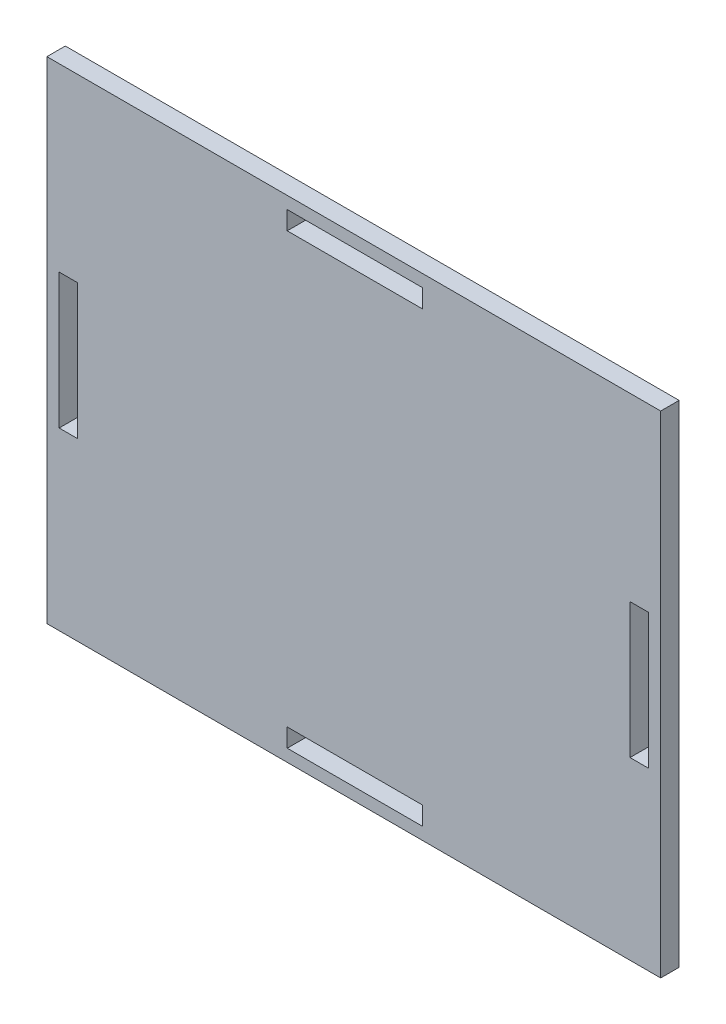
from build123d import *

# Parameters (mm, degrees)
SKETCH1_W           = 100
SKETCH1_H           = 80
SKETCH1_W_2         = 3
SKETCH1_H_2         = 22
SKETCH1_W_3         = 22
SKETCH1_H_3         = 3
BOSS_EXTRUDE1_DEPTH = 3


with BuildPart() as part:
    # Sketch1 → Boss-Extrude1 (new body)
    with BuildSketch(Plane.XY):
        with Locations((50, 40)):
            Rectangle(SKETCH1_W, SKETCH1_H)
        with Locations((96.5, 39.602473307)):
            Rectangle(SKETCH1_W_2, SKETCH1_H_2, mode=Mode.SUBTRACT)
        with Locations((50.157218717, 76.5)):
            Rectangle(SKETCH1_W_3, SKETCH1_H_3, mode=Mode.SUBTRACT)
        with Locations((3.5, 39.602473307)):
            Rectangle(SKETCH1_W_2, SKETCH1_H_2, mode=Mode.SUBTRACT)
        with Locations((50.157218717, 3.5)):
            Rectangle(SKETCH1_W_3, SKETCH1_H_3, mode=Mode.SUBTRACT)
    extrude(amount=BOSS_EXTRUDE1_DEPTH)


solid = part.part
